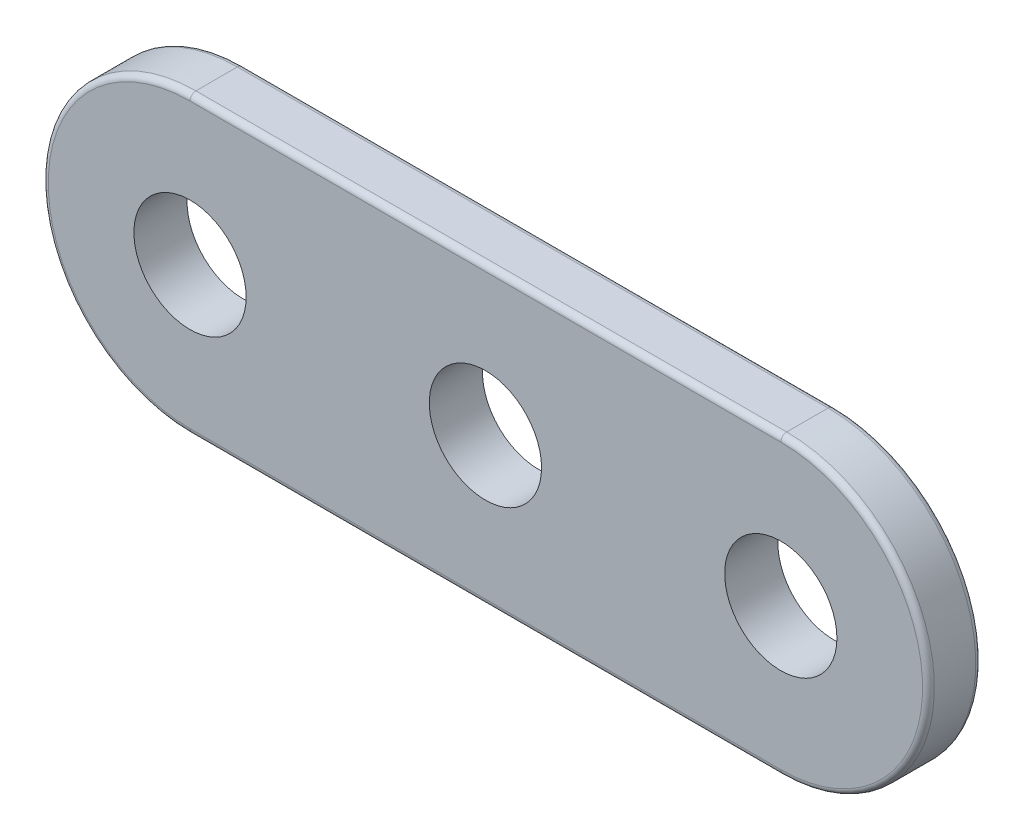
ISO-10303-21;
HEADER;
FILE_DESCRIPTION(('STEP AP214'),'2;1');
FILE_NAME('part.step','',(''),(''),'','','');
FILE_SCHEMA(('AUTOMOTIVE_DESIGN { 1 0 10303 214 1 1 1 1 }'));
ENDSEC;
DATA;
#1=APPLICATION_CONTEXT('core data for automotive mechanical design processes');
#2=APPLICATION_PROTOCOL_DEFINITION('international standard','automotive_design',2000,#1);
#3=PRODUCT_CONTEXT('',#1,'mechanical');
#4=PRODUCT('Part','Part','',(#3));
#5=PRODUCT_RELATED_PRODUCT_CATEGORY('part','',(#4));
#6=PRODUCT_DEFINITION_FORMATION('','',#4);
#7=PRODUCT_DEFINITION_CONTEXT('part definition',#1,'design');
#8=PRODUCT_DEFINITION('design','',#6,#7);
#9=PRODUCT_DEFINITION_SHAPE('','',#8);
#10=(LENGTH_UNIT() NAMED_UNIT(*) SI_UNIT(.MILLI.,.METRE.));
#11=(NAMED_UNIT(*) PLANE_ANGLE_UNIT() SI_UNIT($,.RADIAN.));
#12=(NAMED_UNIT(*) SI_UNIT($,.STERADIAN.) SOLID_ANGLE_UNIT());
#13=UNCERTAINTY_MEASURE_WITH_UNIT(LENGTH_MEASURE(1.E-05),#10,'distance_accuracy_value','');
#14=(GEOMETRIC_REPRESENTATION_CONTEXT(3) GLOBAL_UNCERTAINTY_ASSIGNED_CONTEXT((#13)) GLOBAL_UNIT_ASSIGNED_CONTEXT((#10,
#11,#12)) REPRESENTATION_CONTEXT('',''));
#15=CARTESIAN_POINT('',(0.,0.,0.));
#16=DIRECTION('',(0.,0.,1.));
#17=DIRECTION('',(1.,0.,0.));
#18=AXIS2_PLACEMENT_3D('',#15,#16,#17);
#19=CARTESIAN_POINT('',(-12.7,0.,2.286));
#20=DIRECTION('',(0.,0.,-1.));
#21=DIRECTION('',(-1.,0.,0.));
#22=AXIS2_PLACEMENT_3D('',#19,#20,#21);
#23=CYLINDRICAL_SURFACE('',#22,6.35);
#24=DIRECTION('',(0.,0.,-1.));
#25=VECTOR('',#24,1.);
#26=CARTESIAN_POINT('',(-12.7,6.35,2.286));
#27=LINE('',#26,#25);
#28=CARTESIAN_POINT('',(-12.7,6.35,2.032));
#29=VERTEX_POINT('',#28);
#30=CARTESIAN_POINT('',(-12.7,6.35,0.254));
#31=VERTEX_POINT('',#30);
#32=EDGE_CURVE('E104',#29,#31,#27,.T.);
#33=ORIENTED_EDGE('',*,*,#32,.T.);
#34=CARTESIAN_POINT('',(-12.7,0.,0.254));
#35=DIRECTION('',(0.,0.,1.));
#36=DIRECTION('',(1.,0.,0.));
#37=AXIS2_PLACEMENT_3D('',#34,#35,#36);
#38=CIRCLE('',#37,6.35);
#39=CARTESIAN_POINT('',(-12.7,-6.35,0.254));
#40=VERTEX_POINT('',#39);
#41=EDGE_CURVE('E201',#31,#40,#38,.T.);
#42=ORIENTED_EDGE('',*,*,#41,.T.);
#43=DIRECTION('',(0.,0.,-1.));
#44=VECTOR('',#43,1.);
#45=CARTESIAN_POINT('',(-12.7,-6.35,2.286));
#46=LINE('',#45,#44);
#47=CARTESIAN_POINT('',(-12.7,-6.35,2.032));
#48=VERTEX_POINT('',#47);
#49=EDGE_CURVE('E130',#48,#40,#46,.T.);
#50=ORIENTED_EDGE('',*,*,#49,.F.);
#51=CARTESIAN_POINT('',(-12.7,0.,2.032));
#52=DIRECTION('',(0.,0.,1.));
#53=DIRECTION('',(1.,0.,0.));
#54=AXIS2_PLACEMENT_3D('',#51,#52,#53);
#55=CIRCLE('',#54,6.35);
#56=EDGE_CURVE('E199',#48,#29,#55,.F.);
#57=ORIENTED_EDGE('',*,*,#56,.T.);
#58=EDGE_LOOP('',(#33,#42,#50,#57));
#59=FACE_BOUND('',#58,.T.);
#60=ADVANCED_FACE('F33',(#59),#23,.T.);
#61=CARTESIAN_POINT('',(-12.7,-6.35,2.286));
#62=DIRECTION('',(0.,1.,0.));
#63=DIRECTION('',(-1.,0.,0.));
#64=AXIS2_PLACEMENT_3D('',#61,#62,#63);
#65=PLANE('',#64);
#66=ORIENTED_EDGE('',*,*,#49,.T.);
#67=DIRECTION('',(1.,0.,0.));
#68=VECTOR('',#67,1.);
#69=CARTESIAN_POINT('',(-12.7,-6.35,0.254));
#70=LINE('',#69,#68);
#71=CARTESIAN_POINT('',(12.7,-6.35,0.254));
#72=VERTEX_POINT('',#71);
#73=EDGE_CURVE('E197',#40,#72,#70,.T.);
#74=ORIENTED_EDGE('',*,*,#73,.T.);
#75=DIRECTION('',(0.,0.,-1.));
#76=VECTOR('',#75,1.);
#77=CARTESIAN_POINT('',(12.7,-6.35,2.286));
#78=LINE('',#77,#76);
#79=CARTESIAN_POINT('',(12.7,-6.35,2.032));
#80=VERTEX_POINT('',#79);
#81=EDGE_CURVE('E121',#80,#72,#78,.T.);
#82=ORIENTED_EDGE('',*,*,#81,.F.);
#83=DIRECTION('',(1.,0.,0.));
#84=VECTOR('',#83,1.);
#85=CARTESIAN_POINT('',(-12.7,-6.35,2.032));
#86=LINE('',#85,#84);
#87=EDGE_CURVE('E195',#80,#48,#86,.F.);
#88=ORIENTED_EDGE('',*,*,#87,.T.);
#89=EDGE_LOOP('',(#66,#74,#82,#88));
#90=FACE_BOUND('',#89,.T.);
#91=ADVANCED_FACE('F213',(#90),#65,.F.);
#92=CARTESIAN_POINT('',(12.7,0.,2.286));
#93=DIRECTION('',(0.,0.,-1.));
#94=DIRECTION('',(-1.,0.,0.));
#95=AXIS2_PLACEMENT_3D('',#92,#93,#94);
#96=CYLINDRICAL_SURFACE('',#95,6.35);
#97=ORIENTED_EDGE('',*,*,#81,.T.);
#98=CARTESIAN_POINT('',(12.7,0.,0.254));
#99=DIRECTION('',(0.,0.,1.));
#100=DIRECTION('',(1.,0.,0.));
#101=AXIS2_PLACEMENT_3D('',#98,#99,#100);
#102=CIRCLE('',#101,6.35);
#103=CARTESIAN_POINT('',(12.7,6.35000000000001,0.254));
#104=VERTEX_POINT('',#103);
#105=EDGE_CURVE('E120',#72,#104,#102,.T.);
#106=ORIENTED_EDGE('',*,*,#105,.T.);
#107=DIRECTION('',(0.,0.,-1.));
#108=VECTOR('',#107,1.);
#109=CARTESIAN_POINT('',(12.7,6.35000000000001,2.286));
#110=LINE('',#109,#108);
#111=CARTESIAN_POINT('',(12.7,6.35000000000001,2.032));
#112=VERTEX_POINT('',#111);
#113=EDGE_CURVE('E102',#112,#104,#110,.T.);
#114=ORIENTED_EDGE('',*,*,#113,.F.);
#115=CARTESIAN_POINT('',(12.7,0.,2.032));
#116=DIRECTION('',(0.,0.,1.));
#117=DIRECTION('',(1.,0.,0.));
#118=AXIS2_PLACEMENT_3D('',#115,#116,#117);
#119=CIRCLE('',#118,6.35);
#120=EDGE_CURVE('E117',#112,#80,#119,.F.);
#121=ORIENTED_EDGE('',*,*,#120,.T.);
#122=EDGE_LOOP('',(#97,#106,#114,#121));
#123=FACE_BOUND('',#122,.T.);
#124=ADVANCED_FACE('F116',(#123),#96,.T.);
#125=CARTESIAN_POINT('',(-12.7,6.35,2.286));
#126=DIRECTION('',(0.,-1.,0.));
#127=DIRECTION('',(1.,0.,0.));
#128=AXIS2_PLACEMENT_3D('',#125,#126,#127);
#129=PLANE('',#128);
#130=ORIENTED_EDGE('',*,*,#113,.T.);
#131=DIRECTION('',(-1.,0.,0.));
#132=VECTOR('',#131,1.);
#133=CARTESIAN_POINT('',(-12.7,6.35,0.254));
#134=LINE('',#133,#132);
#135=EDGE_CURVE('E11',#104,#31,#134,.T.);
#136=ORIENTED_EDGE('',*,*,#135,.T.);
#137=ORIENTED_EDGE('',*,*,#32,.F.);
#138=DIRECTION('',(-1.,0.,0.));
#139=VECTOR('',#138,1.);
#140=CARTESIAN_POINT('',(12.7,6.35000000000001,2.032));
#141=LINE('',#140,#139);
#142=EDGE_CURVE('E42',#29,#112,#141,.F.);
#143=ORIENTED_EDGE('',*,*,#142,.T.);
#144=EDGE_LOOP('',(#130,#136,#137,#143));
#145=FACE_BOUND('',#144,.T.);
#146=ADVANCED_FACE('F101',(#145),#129,.F.);
#147=CARTESIAN_POINT('',(-12.7,0.,2.286));
#148=DIRECTION('',(0.,0.,1.));
#149=DIRECTION('',(1.,0.,0.));
#150=AXIS2_PLACEMENT_3D('',#147,#148,#149);
#151=PLANE('',#150);
#152=DIRECTION('',(1.,0.,0.));
#153=VECTOR('',#152,1.);
#154=CARTESIAN_POINT('',(12.7,-6.096,2.286));
#155=LINE('',#154,#153);
#156=CARTESIAN_POINT('',(-12.7,-6.09600000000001,2.286));
#157=VERTEX_POINT('',#156);
#158=CARTESIAN_POINT('',(12.7,-6.096,2.286));
#159=VERTEX_POINT('',#158);
#160=EDGE_CURVE('E50',#157,#159,#155,.T.);
#161=ORIENTED_EDGE('',*,*,#160,.T.);
#162=CARTESIAN_POINT('',(12.7,0.,2.286));
#163=DIRECTION('',(0.,0.,1.));
#164=DIRECTION('',(1.,0.,0.));
#165=AXIS2_PLACEMENT_3D('',#162,#163,#164);
#166=CIRCLE('',#165,6.09600000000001);
#167=CARTESIAN_POINT('',(12.7,6.09600000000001,2.286));
#168=VERTEX_POINT('',#167);
#169=EDGE_CURVE('E109',#159,#168,#166,.T.);
#170=ORIENTED_EDGE('',*,*,#169,.T.);
#171=DIRECTION('',(-1.,0.,0.));
#172=VECTOR('',#171,1.);
#173=CARTESIAN_POINT('',(-12.7,6.09600000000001,2.286));
#174=LINE('',#173,#172);
#175=CARTESIAN_POINT('',(-12.7,6.09600000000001,2.286));
#176=VERTEX_POINT('',#175);
#177=EDGE_CURVE('E133',#168,#176,#174,.T.);
#178=ORIENTED_EDGE('',*,*,#177,.T.);
#179=CARTESIAN_POINT('',(-12.7,0.,2.286));
#180=DIRECTION('',(0.,0.,1.));
#181=DIRECTION('',(1.,0.,0.));
#182=AXIS2_PLACEMENT_3D('',#179,#180,#181);
#183=CIRCLE('',#182,6.09600000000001);
#184=EDGE_CURVE('E55',#176,#157,#183,.T.);
#185=ORIENTED_EDGE('',*,*,#184,.T.);
#186=EDGE_LOOP('',(#161,#170,#178,#185));
#187=FACE_BOUND('',#186,.T.);
#188=CARTESIAN_POINT('',(12.7,0.,2.286));
#189=DIRECTION('',(0.,0.,1.));
#190=DIRECTION('',(1.,0.,0.));
#191=AXIS2_PLACEMENT_3D('',#188,#189,#190);
#192=CIRCLE('',#191,2.41299999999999);
#193=CARTESIAN_POINT('',(15.113,0.,2.286));
#194=VERTEX_POINT('',#193);
#195=EDGE_CURVE('E162',#194,#194,#192,.T.);
#196=ORIENTED_EDGE('',*,*,#195,.F.);
#197=EDGE_LOOP('',(#196));
#198=FACE_BOUND('',#197,.T.);
#199=CARTESIAN_POINT('',(0.,0.,2.286));
#200=DIRECTION('',(0.,0.,1.));
#201=DIRECTION('',(1.,0.,0.));
#202=AXIS2_PLACEMENT_3D('',#199,#200,#201);
#203=CIRCLE('',#202,2.41299999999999);
#204=CARTESIAN_POINT('',(2.41299999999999,0.,2.286));
#205=VERTEX_POINT('',#204);
#206=EDGE_CURVE('E172',#205,#205,#203,.T.);
#207=ORIENTED_EDGE('',*,*,#206,.F.);
#208=EDGE_LOOP('',(#207));
#209=FACE_BOUND('',#208,.T.);
#210=CARTESIAN_POINT('',(-12.7,0.,2.286));
#211=DIRECTION('',(0.,0.,1.));
#212=DIRECTION('',(1.,0.,0.));
#213=AXIS2_PLACEMENT_3D('',#210,#211,#212);
#214=CIRCLE('',#213,2.41299999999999);
#215=CARTESIAN_POINT('',(-10.287,0.,2.286));
#216=VERTEX_POINT('',#215);
#217=EDGE_CURVE('E175',#216,#216,#214,.T.);
#218=ORIENTED_EDGE('',*,*,#217,.F.);
#219=EDGE_LOOP('',(#218));
#220=FACE_BOUND('',#219,.T.);
#221=ADVANCED_FACE('F206',(#187,#198,#209,#220),#151,.T.);
#222=CARTESIAN_POINT('',(-12.7,0.,0.));
#223=DIRECTION('',(0.,0.,1.));
#224=DIRECTION('',(1.,0.,0.));
#225=AXIS2_PLACEMENT_3D('',#222,#223,#224);
#226=PLANE('',#225);
#227=DIRECTION('',(-1.,0.,0.));
#228=VECTOR('',#227,1.);
#229=CARTESIAN_POINT('',(-12.7,6.09600000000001,0.));
#230=LINE('',#229,#228);
#231=CARTESIAN_POINT('',(-12.7,6.09600000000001,0.));
#232=VERTEX_POINT('',#231);
#233=CARTESIAN_POINT('',(12.7,6.09600000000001,0.));
#234=VERTEX_POINT('',#233);
#235=EDGE_CURVE('E186',#232,#234,#230,.F.);
#236=ORIENTED_EDGE('',*,*,#235,.T.);
#237=CARTESIAN_POINT('',(12.7,0.,0.));
#238=DIRECTION('',(0.,0.,1.));
#239=DIRECTION('',(1.,0.,0.));
#240=AXIS2_PLACEMENT_3D('',#237,#238,#239);
#241=CIRCLE('',#240,6.09600000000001);
#242=CARTESIAN_POINT('',(12.7,-6.096,0.));
#243=VERTEX_POINT('',#242);
#244=EDGE_CURVE('E192',#234,#243,#241,.F.);
#245=ORIENTED_EDGE('',*,*,#244,.T.);
#246=DIRECTION('',(1.,0.,0.));
#247=VECTOR('',#246,1.);
#248=CARTESIAN_POINT('',(-12.7,-6.09600000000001,0.));
#249=LINE('',#248,#247);
#250=CARTESIAN_POINT('',(-12.7,-6.09600000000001,0.));
#251=VERTEX_POINT('',#250);
#252=EDGE_CURVE('E190',#243,#251,#249,.F.);
#253=ORIENTED_EDGE('',*,*,#252,.T.);
#254=CARTESIAN_POINT('',(-12.7,0.,0.));
#255=DIRECTION('',(0.,0.,1.));
#256=DIRECTION('',(1.,0.,0.));
#257=AXIS2_PLACEMENT_3D('',#254,#255,#256);
#258=CIRCLE('',#257,6.09600000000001);
#259=EDGE_CURVE('E188',#251,#232,#258,.F.);
#260=ORIENTED_EDGE('',*,*,#259,.T.);
#261=EDGE_LOOP('',(#236,#245,#253,#260));
#262=FACE_BOUND('',#261,.T.);
#263=CARTESIAN_POINT('',(12.7,0.,0.));
#264=DIRECTION('',(0.,0.,1.));
#265=DIRECTION('',(1.,0.,0.));
#266=AXIS2_PLACEMENT_3D('',#263,#264,#265);
#267=CIRCLE('',#266,2.41299999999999);
#268=CARTESIAN_POINT('',(15.113,0.,0.));
#269=VERTEX_POINT('',#268);
#270=EDGE_CURVE('E156',#269,#269,#267,.T.);
#271=ORIENTED_EDGE('',*,*,#270,.T.);
#272=EDGE_LOOP('',(#271));
#273=FACE_BOUND('',#272,.T.);
#274=CARTESIAN_POINT('',(0.,0.,0.));
#275=DIRECTION('',(0.,0.,1.));
#276=DIRECTION('',(1.,0.,0.));
#277=AXIS2_PLACEMENT_3D('',#274,#275,#276);
#278=CIRCLE('',#277,2.41299999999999);
#279=CARTESIAN_POINT('',(2.41299999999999,0.,0.));
#280=VERTEX_POINT('',#279);
#281=EDGE_CURVE('E167',#280,#280,#278,.T.);
#282=ORIENTED_EDGE('',*,*,#281,.T.);
#283=EDGE_LOOP('',(#282));
#284=FACE_BOUND('',#283,.T.);
#285=CARTESIAN_POINT('',(-12.7,0.,0.));
#286=DIRECTION('',(0.,0.,1.));
#287=DIRECTION('',(1.,0.,0.));
#288=AXIS2_PLACEMENT_3D('',#285,#286,#287);
#289=CIRCLE('',#288,2.41299999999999);
#290=CARTESIAN_POINT('',(-10.287,0.,0.));
#291=VERTEX_POINT('',#290);
#292=EDGE_CURVE('E176',#291,#291,#289,.T.);
#293=ORIENTED_EDGE('',*,*,#292,.T.);
#294=EDGE_LOOP('',(#293));
#295=FACE_BOUND('',#294,.T.);
#296=ADVANCED_FACE('F241',(#262,#273,#284,#295),#226,.F.);
#297=CARTESIAN_POINT('',(-12.7,0.,0.));
#298=DIRECTION('',(0.,0.,1.));
#299=DIRECTION('',(1.,0.,0.));
#300=AXIS2_PLACEMENT_3D('',#297,#298,#299);
#301=CYLINDRICAL_SURFACE('',#300,2.41299999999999);
#302=ORIENTED_EDGE('',*,*,#292,.F.);
#303=EDGE_LOOP('',(#302));
#304=FACE_BOUND('',#303,.T.);
#305=ORIENTED_EDGE('',*,*,#217,.T.);
#306=EDGE_LOOP('',(#305));
#307=FACE_BOUND('',#306,.T.);
#308=ADVANCED_FACE('F244',(#304,#307),#301,.F.);
#309=CARTESIAN_POINT('',(0.,0.,0.));
#310=DIRECTION('',(0.,0.,1.));
#311=DIRECTION('',(1.,0.,0.));
#312=AXIS2_PLACEMENT_3D('',#309,#310,#311);
#313=CYLINDRICAL_SURFACE('',#312,2.41299999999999);
#314=ORIENTED_EDGE('',*,*,#281,.F.);
#315=EDGE_LOOP('',(#314));
#316=FACE_BOUND('',#315,.T.);
#317=ORIENTED_EDGE('',*,*,#206,.T.);
#318=EDGE_LOOP('',(#317));
#319=FACE_BOUND('',#318,.T.);
#320=ADVANCED_FACE('F250',(#316,#319),#313,.F.);
#321=CARTESIAN_POINT('',(12.7,0.,0.));
#322=DIRECTION('',(0.,0.,1.));
#323=DIRECTION('',(1.,0.,0.));
#324=AXIS2_PLACEMENT_3D('',#321,#322,#323);
#325=CYLINDRICAL_SURFACE('',#324,2.41299999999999);
#326=ORIENTED_EDGE('',*,*,#270,.F.);
#327=EDGE_LOOP('',(#326));
#328=FACE_BOUND('',#327,.T.);
#329=ORIENTED_EDGE('',*,*,#195,.T.);
#330=EDGE_LOOP('',(#329));
#331=FACE_BOUND('',#330,.T.);
#332=ADVANCED_FACE('F254',(#328,#331),#325,.F.);
#333=CARTESIAN_POINT('',(-12.7,0.,0.254));
#334=DIRECTION('',(0.,0.,1.));
#335=DIRECTION('',(1.,0.,0.));
#336=AXIS2_PLACEMENT_3D('',#333,#334,#335);
#337=TOROIDAL_SURFACE('',#336,6.09600000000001,0.254);
#338=CARTESIAN_POINT('',(-12.7,6.09600000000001,0.254));
#339=DIRECTION('',(1.,0.,0.));
#340=DIRECTION('',(0.,0.,-1.));
#341=AXIS2_PLACEMENT_3D('',#338,#339,#340);
#342=CIRCLE('',#341,0.254);
#343=EDGE_CURVE('E149',#232,#31,#342,.T.);
#344=ORIENTED_EDGE('',*,*,#343,.F.);
#345=ORIENTED_EDGE('',*,*,#259,.F.);
#346=CARTESIAN_POINT('',(-12.7,-6.09600000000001,0.254));
#347=DIRECTION('',(1.,0.,0.));
#348=DIRECTION('',(0.,0.,-1.));
#349=AXIS2_PLACEMENT_3D('',#346,#347,#348);
#350=CIRCLE('',#349,0.254);
#351=EDGE_CURVE('E138',#40,#251,#350,.T.);
#352=ORIENTED_EDGE('',*,*,#351,.F.);
#353=ORIENTED_EDGE('',*,*,#41,.F.);
#354=EDGE_LOOP('',(#344,#345,#352,#353));
#355=FACE_BOUND('',#354,.T.);
#356=ADVANCED_FACE('F217',(#355),#337,.T.);
#357=CARTESIAN_POINT('',(-12.7,-6.09600000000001,0.254));
#358=DIRECTION('',(1.,0.,0.));
#359=DIRECTION('',(0.,1.,0.));
#360=AXIS2_PLACEMENT_3D('',#357,#358,#359);
#361=CYLINDRICAL_SURFACE('',#360,0.254);
#362=ORIENTED_EDGE('',*,*,#351,.T.);
#363=ORIENTED_EDGE('',*,*,#252,.F.);
#364=CARTESIAN_POINT('',(12.7,-6.096,0.254));
#365=DIRECTION('',(1.,0.,0.));
#366=DIRECTION('',(0.,0.,-1.));
#367=AXIS2_PLACEMENT_3D('',#364,#365,#366);
#368=CIRCLE('',#367,0.254);
#369=EDGE_CURVE('E143',#72,#243,#368,.T.);
#370=ORIENTED_EDGE('',*,*,#369,.F.);
#371=ORIENTED_EDGE('',*,*,#73,.F.);
#372=EDGE_LOOP('',(#362,#363,#370,#371));
#373=FACE_BOUND('',#372,.T.);
#374=ADVANCED_FACE('F220',(#373),#361,.T.);
#375=CARTESIAN_POINT('',(-12.7,6.09600000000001,0.254));
#376=DIRECTION('',(-1.,0.,0.));
#377=DIRECTION('',(0.,-1.,0.));
#378=AXIS2_PLACEMENT_3D('',#375,#376,#377);
#379=CYLINDRICAL_SURFACE('',#378,0.254);
#380=ORIENTED_EDGE('',*,*,#343,.T.);
#381=ORIENTED_EDGE('',*,*,#135,.F.);
#382=CARTESIAN_POINT('',(12.7,6.09600000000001,0.254));
#383=DIRECTION('',(1.,0.,0.));
#384=DIRECTION('',(0.,0.,-1.));
#385=AXIS2_PLACEMENT_3D('',#382,#383,#384);
#386=CIRCLE('',#385,0.254);
#387=EDGE_CURVE('E141',#234,#104,#386,.T.);
#388=ORIENTED_EDGE('',*,*,#387,.F.);
#389=ORIENTED_EDGE('',*,*,#235,.F.);
#390=EDGE_LOOP('',(#380,#381,#388,#389));
#391=FACE_BOUND('',#390,.T.);
#392=ADVANCED_FACE('F223',(#391),#379,.T.);
#393=CARTESIAN_POINT('',(12.7,0.,0.254));
#394=DIRECTION('',(0.,0.,1.));
#395=DIRECTION('',(1.,0.,0.));
#396=AXIS2_PLACEMENT_3D('',#393,#394,#395);
#397=TOROIDAL_SURFACE('',#396,6.09600000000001,0.254);
#398=ORIENTED_EDGE('',*,*,#369,.T.);
#399=ORIENTED_EDGE('',*,*,#244,.F.);
#400=ORIENTED_EDGE('',*,*,#387,.T.);
#401=ORIENTED_EDGE('',*,*,#105,.F.);
#402=EDGE_LOOP('',(#398,#399,#400,#401));
#403=FACE_BOUND('',#402,.T.);
#404=ADVANCED_FACE('F221',(#403),#397,.T.);
#405=CARTESIAN_POINT('',(-12.7,0.,2.032));
#406=DIRECTION('',(0.,0.,1.));
#407=DIRECTION('',(1.,0.,0.));
#408=AXIS2_PLACEMENT_3D('',#405,#406,#407);
#409=TOROIDAL_SURFACE('',#408,6.09600000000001,0.254);
#410=CARTESIAN_POINT('',(-12.7,6.09600000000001,2.032));
#411=DIRECTION('',(1.,0.,0.));
#412=DIRECTION('',(0.,0.,-1.));
#413=AXIS2_PLACEMENT_3D('',#410,#411,#412);
#414=CIRCLE('',#413,0.254);
#415=EDGE_CURVE('E135',#29,#176,#414,.T.);
#416=ORIENTED_EDGE('',*,*,#415,.F.);
#417=ORIENTED_EDGE('',*,*,#56,.F.);
#418=CARTESIAN_POINT('',(-12.7,-6.09600000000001,2.032));
#419=DIRECTION('',(1.,0.,0.));
#420=DIRECTION('',(0.,0.,-1.));
#421=AXIS2_PLACEMENT_3D('',#418,#419,#420);
#422=CIRCLE('',#421,0.254);
#423=EDGE_CURVE('E37',#157,#48,#422,.T.);
#424=ORIENTED_EDGE('',*,*,#423,.F.);
#425=ORIENTED_EDGE('',*,*,#184,.F.);
#426=EDGE_LOOP('',(#416,#417,#424,#425));
#427=FACE_BOUND('',#426,.T.);
#428=ADVANCED_FACE('F35',(#427),#409,.T.);
#429=CARTESIAN_POINT('',(-12.7,-6.09600000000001,2.032));
#430=DIRECTION('',(-1.,0.,0.));
#431=DIRECTION('',(0.,-1.,0.));
#432=AXIS2_PLACEMENT_3D('',#429,#430,#431);
#433=CYLINDRICAL_SURFACE('',#432,0.254);
#434=ORIENTED_EDGE('',*,*,#423,.T.);
#435=ORIENTED_EDGE('',*,*,#87,.F.);
#436=CARTESIAN_POINT('',(12.7,-6.096,2.032));
#437=DIRECTION('',(1.,0.,0.));
#438=DIRECTION('',(0.,0.,-1.));
#439=AXIS2_PLACEMENT_3D('',#436,#437,#438);
#440=CIRCLE('',#439,0.254);
#441=EDGE_CURVE('E128',#159,#80,#440,.T.);
#442=ORIENTED_EDGE('',*,*,#441,.F.);
#443=ORIENTED_EDGE('',*,*,#160,.F.);
#444=EDGE_LOOP('',(#434,#435,#442,#443));
#445=FACE_BOUND('',#444,.T.);
#446=ADVANCED_FACE('F210',(#445),#433,.T.);
#447=CARTESIAN_POINT('',(-12.7,6.09600000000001,2.032));
#448=DIRECTION('',(1.,0.,0.));
#449=DIRECTION('',(0.,1.,0.));
#450=AXIS2_PLACEMENT_3D('',#447,#448,#449);
#451=CYLINDRICAL_SURFACE('',#450,0.254);
#452=ORIENTED_EDGE('',*,*,#415,.T.);
#453=ORIENTED_EDGE('',*,*,#177,.F.);
#454=CARTESIAN_POINT('',(12.7,6.09600000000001,2.032));
#455=DIRECTION('',(1.,0.,0.));
#456=DIRECTION('',(0.,0.,-1.));
#457=AXIS2_PLACEMENT_3D('',#454,#455,#456);
#458=CIRCLE('',#457,0.254);
#459=EDGE_CURVE('E126',#112,#168,#458,.T.);
#460=ORIENTED_EDGE('',*,*,#459,.F.);
#461=ORIENTED_EDGE('',*,*,#142,.F.);
#462=EDGE_LOOP('',(#452,#453,#460,#461));
#463=FACE_BOUND('',#462,.T.);
#464=ADVANCED_FACE('F132',(#463),#451,.T.);
#465=CARTESIAN_POINT('',(12.7,0.,2.032));
#466=DIRECTION('',(0.,0.,1.));
#467=DIRECTION('',(1.,0.,0.));
#468=AXIS2_PLACEMENT_3D('',#465,#466,#467);
#469=TOROIDAL_SURFACE('',#468,6.09600000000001,0.254);
#470=ORIENTED_EDGE('',*,*,#441,.T.);
#471=ORIENTED_EDGE('',*,*,#120,.F.);
#472=ORIENTED_EDGE('',*,*,#459,.T.);
#473=ORIENTED_EDGE('',*,*,#169,.F.);
#474=EDGE_LOOP('',(#470,#471,#472,#473));
#475=FACE_BOUND('',#474,.T.);
#476=ADVANCED_FACE('F124',(#475),#469,.T.);
#477=CLOSED_SHELL('',(#60,#91,#124,#146,#221,#296,#308,#320,#332,#356,#374,#392,#404,#428,#446,
#464,#476));
#478=MANIFOLD_SOLID_BREP('B2',#477);
#479=ADVANCED_BREP_SHAPE_REPRESENTATION('',(#18,#478),#14);
#480=SHAPE_DEFINITION_REPRESENTATION(#9,#479);
ENDSEC;
END-ISO-10303-21;
